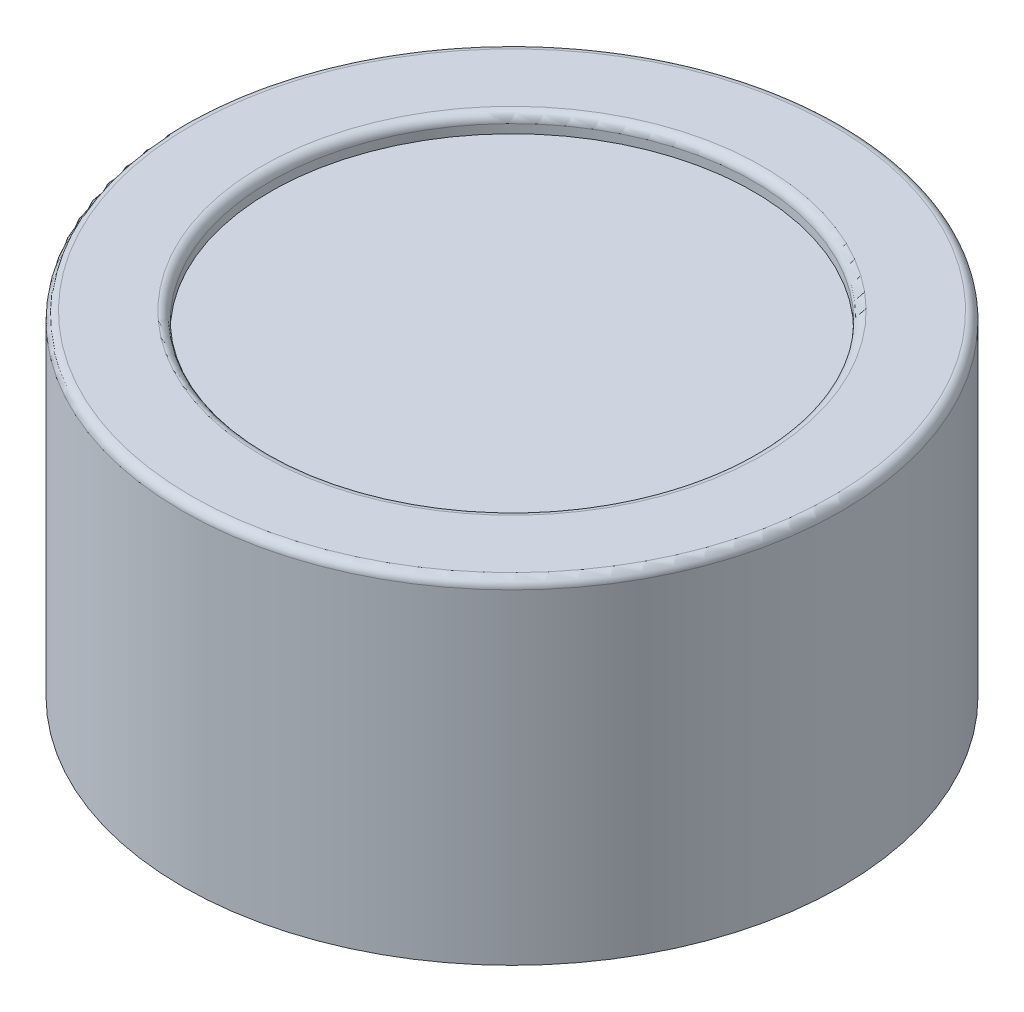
ISO-10303-21;
HEADER;
FILE_DESCRIPTION(('STEP AP214'),'2;1');
FILE_NAME('part.step','',(''),(''),'','','');
FILE_SCHEMA(('AUTOMOTIVE_DESIGN { 1 0 10303 214 1 1 1 1 }'));
ENDSEC;
DATA;
#1=APPLICATION_CONTEXT('core data for automotive mechanical design processes');
#2=APPLICATION_PROTOCOL_DEFINITION('international standard','automotive_design',2000,#1);
#3=PRODUCT_CONTEXT('',#1,'mechanical');
#4=PRODUCT('Part','Part','',(#3));
#5=PRODUCT_RELATED_PRODUCT_CATEGORY('part','',(#4));
#6=PRODUCT_DEFINITION_FORMATION('','',#4);
#7=PRODUCT_DEFINITION_CONTEXT('part definition',#1,'design');
#8=PRODUCT_DEFINITION('design','',#6,#7);
#9=PRODUCT_DEFINITION_SHAPE('','',#8);
#10=(LENGTH_UNIT() NAMED_UNIT(*) SI_UNIT(.MILLI.,.METRE.));
#11=(NAMED_UNIT(*) PLANE_ANGLE_UNIT() SI_UNIT($,.RADIAN.));
#12=(NAMED_UNIT(*) SI_UNIT($,.STERADIAN.) SOLID_ANGLE_UNIT());
#13=UNCERTAINTY_MEASURE_WITH_UNIT(LENGTH_MEASURE(1.E-05),#10,'distance_accuracy_value','');
#14=(GEOMETRIC_REPRESENTATION_CONTEXT(3) GLOBAL_UNCERTAINTY_ASSIGNED_CONTEXT((#13)) GLOBAL_UNIT_ASSIGNED_CONTEXT((#10,
#11,#12)) REPRESENTATION_CONTEXT('',''));
#15=CARTESIAN_POINT('',(0.,0.,0.));
#16=DIRECTION('',(0.,0.,1.));
#17=DIRECTION('',(1.,0.,0.));
#18=AXIS2_PLACEMENT_3D('',#15,#16,#17);
#19=CARTESIAN_POINT('',(0.,19.,0.));
#20=DIRECTION('',(0.,1.,0.));
#21=DIRECTION('',(0.,0.,1.));
#22=AXIS2_PLACEMENT_3D('',#19,#20,#21);
#23=PLANE('',#22);
#24=CARTESIAN_POINT('',(0.,19.,0.));
#25=DIRECTION('',(0.,1.,0.));
#26=DIRECTION('',(0.,0.,1.));
#27=AXIS2_PLACEMENT_3D('',#24,#25,#26);
#28=CIRCLE('',#27,14.25);
#29=CARTESIAN_POINT('',(0.,19.,14.25));
#30=VERTEX_POINT('',#29);
#31=EDGE_CURVE('E52',#30,#30,#28,.F.);
#32=ORIENTED_EDGE('',*,*,#31,.T.);
#33=EDGE_LOOP('',(#32));
#34=FACE_BOUND('',#33,.T.);
#35=CARTESIAN_POINT('',(0.,19.,0.));
#36=DIRECTION('',(0.,1.,0.));
#37=DIRECTION('',(0.,0.,1.));
#38=AXIS2_PLACEMENT_3D('',#35,#36,#37);
#39=CIRCLE('',#38,18.25);
#40=CARTESIAN_POINT('',(0.,19.,18.25));
#41=VERTEX_POINT('',#40);
#42=EDGE_CURVE('E56',#41,#41,#39,.T.);
#43=ORIENTED_EDGE('',*,*,#42,.T.);
#44=EDGE_LOOP('',(#43));
#45=FACE_BOUND('',#44,.T.);
#46=ADVANCED_FACE('F45',(#34,#45),#23,.T.);
#47=CARTESIAN_POINT('',(0.,19.,0.));
#48=DIRECTION('',(0.,-1.,0.));
#49=DIRECTION('',(0.,0.,-1.));
#50=AXIS2_PLACEMENT_3D('',#47,#48,#49);
#51=CYLINDRICAL_SURFACE('',#50,18.75);
#52=CARTESIAN_POINT('',(0.,18.5,0.));
#53=DIRECTION('',(0.,1.,0.));
#54=DIRECTION('',(0.,0.,1.));
#55=AXIS2_PLACEMENT_3D('',#52,#53,#54);
#56=CIRCLE('',#55,18.75);
#57=CARTESIAN_POINT('',(0.,18.5,18.75));
#58=VERTEX_POINT('',#57);
#59=EDGE_CURVE('E10',#58,#58,#56,.F.);
#60=ORIENTED_EDGE('',*,*,#59,.T.);
#61=EDGE_LOOP('',(#60));
#62=FACE_BOUND('',#61,.T.);
#63=CARTESIAN_POINT('',(0.,0.,0.));
#64=DIRECTION('',(0.,1.,0.));
#65=DIRECTION('',(0.,0.,1.));
#66=AXIS2_PLACEMENT_3D('',#63,#64,#65);
#67=CIRCLE('',#66,18.75);
#68=CARTESIAN_POINT('',(0.,0.,18.75));
#69=VERTEX_POINT('',#68);
#70=EDGE_CURVE('E65',#69,#69,#67,.T.);
#71=ORIENTED_EDGE('',*,*,#70,.T.);
#72=EDGE_LOOP('',(#71));
#73=FACE_BOUND('',#72,.T.);
#74=ADVANCED_FACE('F85',(#62,#73),#51,.T.);
#75=CARTESIAN_POINT('',(0.,0.,0.));
#76=DIRECTION('',(0.,1.,0.));
#77=DIRECTION('',(0.,0.,1.));
#78=AXIS2_PLACEMENT_3D('',#75,#76,#77);
#79=PLANE('',#78);
#80=ORIENTED_EDGE('',*,*,#70,.F.);
#81=EDGE_LOOP('',(#80));
#82=FACE_BOUND('',#81,.T.);
#83=ADVANCED_FACE('F76',(#82),#79,.F.);
#84=CARTESIAN_POINT('',(0.,18.,0.));
#85=DIRECTION('',(0.,1.,0.));
#86=DIRECTION('',(0.,0.,1.));
#87=AXIS2_PLACEMENT_3D('',#84,#85,#86);
#88=CYLINDRICAL_SURFACE('',#87,13.75);
#89=CARTESIAN_POINT('',(0.,18.5,0.));
#90=DIRECTION('',(0.,1.,0.));
#91=DIRECTION('',(0.,0.,1.));
#92=AXIS2_PLACEMENT_3D('',#89,#90,#91);
#93=CIRCLE('',#92,13.75);
#94=CARTESIAN_POINT('',(0.,18.5,13.75));
#95=VERTEX_POINT('',#94);
#96=EDGE_CURVE('E60',#95,#95,#93,.T.);
#97=ORIENTED_EDGE('',*,*,#96,.T.);
#98=EDGE_LOOP('',(#97));
#99=FACE_BOUND('',#98,.T.);
#100=CARTESIAN_POINT('',(0.,18.,0.));
#101=DIRECTION('',(0.,1.,0.));
#102=DIRECTION('',(0.,0.,1.));
#103=AXIS2_PLACEMENT_3D('',#100,#101,#102);
#104=CIRCLE('',#103,13.75);
#105=CARTESIAN_POINT('',(0.,18.,13.75));
#106=VERTEX_POINT('',#105);
#107=EDGE_CURVE('E68',#106,#106,#104,.T.);
#108=ORIENTED_EDGE('',*,*,#107,.F.);
#109=EDGE_LOOP('',(#108));
#110=FACE_BOUND('',#109,.T.);
#111=ADVANCED_FACE('F74',(#99,#110),#88,.F.);
#112=CARTESIAN_POINT('',(0.,18.,0.));
#113=DIRECTION('',(0.,1.,0.));
#114=DIRECTION('',(0.,0.,1.));
#115=AXIS2_PLACEMENT_3D('',#112,#113,#114);
#116=PLANE('',#115);
#117=ORIENTED_EDGE('',*,*,#107,.T.);
#118=EDGE_LOOP('',(#117));
#119=FACE_BOUND('',#118,.T.);
#120=ADVANCED_FACE('F72',(#119),#116,.T.);
#121=CARTESIAN_POINT('',(0.,18.5,0.));
#122=DIRECTION('',(0.,1.,0.));
#123=DIRECTION('',(0.,0.,1.));
#124=AXIS2_PLACEMENT_3D('',#121,#122,#123);
#125=TOROIDAL_SURFACE('',#124,14.25,0.5);
#126=ORIENTED_EDGE('',*,*,#31,.F.);
#127=EDGE_LOOP('',(#126));
#128=FACE_BOUND('',#127,.T.);
#129=ORIENTED_EDGE('',*,*,#96,.F.);
#130=EDGE_LOOP('',(#129));
#131=FACE_BOUND('',#130,.T.);
#132=ADVANCED_FACE('F83',(#128,#131),#125,.T.);
#133=CARTESIAN_POINT('',(0.,18.5,0.));
#134=DIRECTION('',(0.,1.,0.));
#135=DIRECTION('',(0.,0.,1.));
#136=AXIS2_PLACEMENT_3D('',#133,#134,#135);
#137=TOROIDAL_SURFACE('',#136,18.25,0.5);
#138=ORIENTED_EDGE('',*,*,#59,.F.);
#139=EDGE_LOOP('',(#138));
#140=FACE_BOUND('',#139,.T.);
#141=ORIENTED_EDGE('',*,*,#42,.F.);
#142=EDGE_LOOP('',(#141));
#143=FACE_BOUND('',#142,.T.);
#144=ADVANCED_FACE('F47',(#140,#143),#137,.T.);
#145=CLOSED_SHELL('',(#46,#74,#83,#111,#120,#132,#144));
#146=MANIFOLD_SOLID_BREP('B2',#145);
#147=ADVANCED_BREP_SHAPE_REPRESENTATION('',(#18,#146),#14);
#148=SHAPE_DEFINITION_REPRESENTATION(#9,#147);
ENDSEC;
END-ISO-10303-21;
